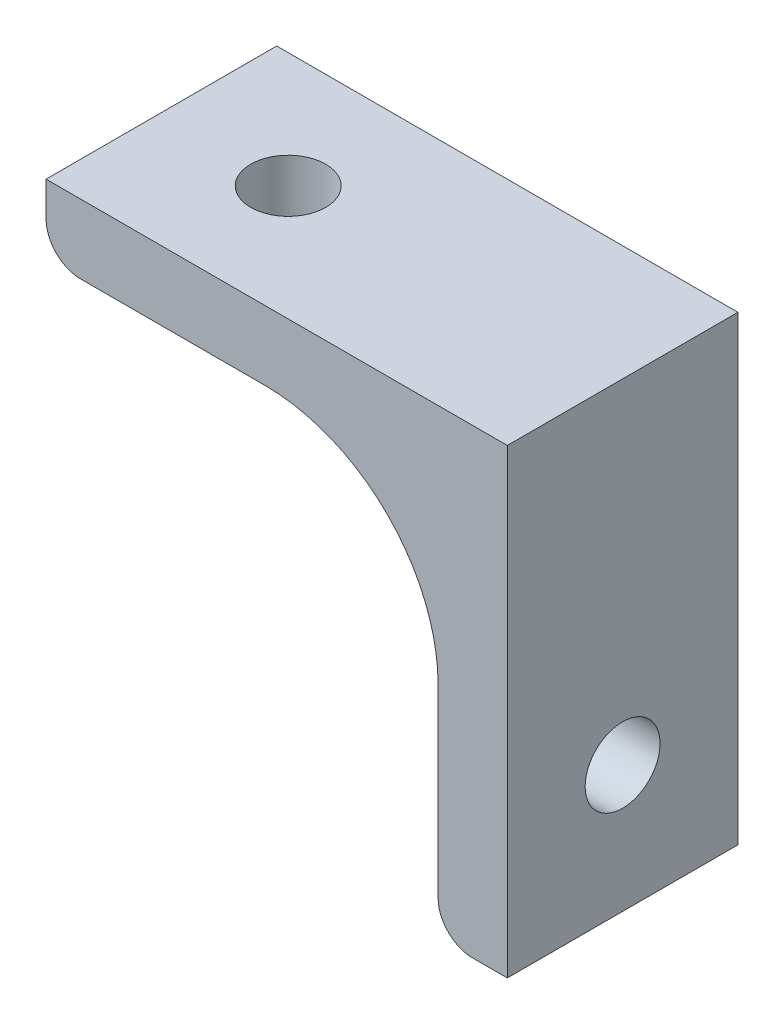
ISO-10303-21;
HEADER;
FILE_DESCRIPTION(('STEP AP214'),'2;1');
FILE_NAME('part.step','',(''),(''),'','','');
FILE_SCHEMA(('AUTOMOTIVE_DESIGN { 1 0 10303 214 1 1 1 1 }'));
ENDSEC;
DATA;
#1=APPLICATION_CONTEXT('core data for automotive mechanical design processes');
#2=APPLICATION_PROTOCOL_DEFINITION('international standard','automotive_design',2000,#1);
#3=PRODUCT_CONTEXT('',#1,'mechanical');
#4=PRODUCT('Part','Part','',(#3));
#5=PRODUCT_RELATED_PRODUCT_CATEGORY('part','',(#4));
#6=PRODUCT_DEFINITION_FORMATION('','',#4);
#7=PRODUCT_DEFINITION_CONTEXT('part definition',#1,'design');
#8=PRODUCT_DEFINITION('design','',#6,#7);
#9=PRODUCT_DEFINITION_SHAPE('','',#8);
#10=(LENGTH_UNIT() NAMED_UNIT(*) SI_UNIT(.MILLI.,.METRE.));
#11=(NAMED_UNIT(*) PLANE_ANGLE_UNIT() SI_UNIT($,.RADIAN.));
#12=(NAMED_UNIT(*) SI_UNIT($,.STERADIAN.) SOLID_ANGLE_UNIT());
#13=UNCERTAINTY_MEASURE_WITH_UNIT(LENGTH_MEASURE(1.E-05),#10,'distance_accuracy_value','');
#14=(GEOMETRIC_REPRESENTATION_CONTEXT(3) GLOBAL_UNCERTAINTY_ASSIGNED_CONTEXT((#13)) GLOBAL_UNIT_ASSIGNED_CONTEXT((#10,
#11,#12)) REPRESENTATION_CONTEXT('',''));
#15=CARTESIAN_POINT('',(0.,0.,0.));
#16=DIRECTION('',(0.,0.,1.));
#17=DIRECTION('',(1.,0.,0.));
#18=AXIS2_PLACEMENT_3D('',#15,#16,#17);
#19=CARTESIAN_POINT('',(-2.99999999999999,-37.,20.));
#20=DIRECTION('',(0.,0.,-1.));
#21=DIRECTION('',(-1.,0.,0.));
#22=AXIS2_PLACEMENT_3D('',#19,#20,#21);
#23=CYLINDRICAL_SURFACE('',#22,3.);
#24=CARTESIAN_POINT('',(-2.99999999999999,-37.,0.));
#25=DIRECTION('',(0.,0.,1.));
#26=DIRECTION('',(1.,0.,0.));
#27=AXIS2_PLACEMENT_3D('',#24,#25,#26);
#28=CIRCLE('',#27,3.);
#29=CARTESIAN_POINT('',(-2.99999999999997,-40.,0.));
#30=VERTEX_POINT('',#29);
#31=CARTESIAN_POINT('',(-5.99999999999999,-37.,0.));
#32=VERTEX_POINT('',#31);
#33=EDGE_CURVE('E108',#30,#32,#28,.F.);
#34=ORIENTED_EDGE('',*,*,#33,.F.);
#35=DIRECTION('',(0.,0.,-1.));
#36=VECTOR('',#35,1.);
#37=CARTESIAN_POINT('',(-2.99999999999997,-40.,20.));
#38=LINE('',#37,#36);
#39=CARTESIAN_POINT('',(-2.99999999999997,-40.,20.));
#40=VERTEX_POINT('',#39);
#41=EDGE_CURVE('E11',#40,#30,#38,.T.);
#42=ORIENTED_EDGE('',*,*,#41,.F.);
#43=CARTESIAN_POINT('',(-2.99999999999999,-37.,20.));
#44=DIRECTION('',(0.,0.,1.));
#45=DIRECTION('',(1.,0.,0.));
#46=AXIS2_PLACEMENT_3D('',#43,#44,#45);
#47=CIRCLE('',#46,3.);
#48=CARTESIAN_POINT('',(-5.99999999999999,-37.,20.));
#49=VERTEX_POINT('',#48);
#50=EDGE_CURVE('E139',#40,#49,#47,.F.);
#51=ORIENTED_EDGE('',*,*,#50,.T.);
#52=DIRECTION('',(0.,0.,-1.));
#53=VECTOR('',#52,1.);
#54=CARTESIAN_POINT('',(-5.99999999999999,-37.,20.));
#55=LINE('',#54,#53);
#56=EDGE_CURVE('E109',#49,#32,#55,.T.);
#57=ORIENTED_EDGE('',*,*,#56,.T.);
#58=EDGE_LOOP('',(#34,#42,#51,#57));
#59=FACE_BOUND('',#58,.T.);
#60=ADVANCED_FACE('F27',(#59),#23,.T.);
#61=CARTESIAN_POINT('',(-10.,-40.,20.));
#62=DIRECTION('',(0.,-1.,0.));
#63=DIRECTION('',(0.,0.,-1.));
#64=AXIS2_PLACEMENT_3D('',#61,#62,#63);
#65=PLANE('',#64);
#66=DIRECTION('',(-1.,0.,0.));
#67=VECTOR('',#66,1.);
#68=CARTESIAN_POINT('',(-10.,-40.,0.));
#69=LINE('',#68,#67);
#70=CARTESIAN_POINT('',(0.,-40.,0.));
#71=VERTEX_POINT('',#70);
#72=EDGE_CURVE('E101',#71,#30,#69,.T.);
#73=ORIENTED_EDGE('',*,*,#72,.F.);
#74=DIRECTION('',(0.,0.,-1.));
#75=VECTOR('',#74,1.);
#76=CARTESIAN_POINT('',(0.,-40.,20.));
#77=LINE('',#76,#75);
#78=CARTESIAN_POINT('',(0.,-40.,20.));
#79=VERTEX_POINT('',#78);
#80=EDGE_CURVE('E34',#79,#71,#77,.T.);
#81=ORIENTED_EDGE('',*,*,#80,.F.);
#82=DIRECTION('',(-1.,0.,0.));
#83=VECTOR('',#82,1.);
#84=CARTESIAN_POINT('',(-10.,-40.,20.));
#85=LINE('',#84,#83);
#86=EDGE_CURVE('E104',#79,#40,#85,.T.);
#87=ORIENTED_EDGE('',*,*,#86,.T.);
#88=ORIENTED_EDGE('',*,*,#41,.T.);
#89=EDGE_LOOP('',(#73,#81,#87,#88));
#90=FACE_BOUND('',#89,.T.);
#91=ADVANCED_FACE('F99',(#90),#65,.T.);
#92=CARTESIAN_POINT('',(0.,-63.2541197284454,20.));
#93=DIRECTION('',(1.,0.,0.));
#94=DIRECTION('',(0.,1.,0.));
#95=AXIS2_PLACEMENT_3D('',#92,#93,#94);
#96=PLANE('',#95);
#97=CARTESIAN_POINT('',(0.,-29.,10.));
#98=DIRECTION('',(1.,0.,0.));
#99=DIRECTION('',(0.,1.,0.));
#100=AXIS2_PLACEMENT_3D('',#97,#98,#99);
#101=CIRCLE('',#100,3.25);
#102=CARTESIAN_POINT('',(0.,-25.75,10.));
#103=VERTEX_POINT('',#102);
#104=EDGE_CURVE('E278',#103,#103,#101,.T.);
#105=ORIENTED_EDGE('',*,*,#104,.F.);
#106=EDGE_LOOP('',(#105));
#107=FACE_BOUND('',#106,.T.);
#108=DIRECTION('',(0.,-1.,0.));
#109=VECTOR('',#108,1.);
#110=CARTESIAN_POINT('',(0.,-63.2541197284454,0.));
#111=LINE('',#110,#109);
#112=CARTESIAN_POINT('',(0.,0.,0.));
#113=VERTEX_POINT('',#112);
#114=EDGE_CURVE('E118',#113,#71,#111,.T.);
#115=ORIENTED_EDGE('',*,*,#114,.F.);
#116=DIRECTION('',(0.,0.,-1.));
#117=VECTOR('',#116,1.);
#118=CARTESIAN_POINT('',(0.,0.,20.));
#119=LINE('',#118,#117);
#120=CARTESIAN_POINT('',(0.,0.,20.));
#121=VERTEX_POINT('',#120);
#122=EDGE_CURVE('E168',#121,#113,#119,.T.);
#123=ORIENTED_EDGE('',*,*,#122,.F.);
#124=DIRECTION('',(0.,-1.,0.));
#125=VECTOR('',#124,1.);
#126=CARTESIAN_POINT('',(0.,-63.2541197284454,20.));
#127=LINE('',#126,#125);
#128=EDGE_CURVE('E142',#121,#79,#127,.T.);
#129=ORIENTED_EDGE('',*,*,#128,.T.);
#130=ORIENTED_EDGE('',*,*,#80,.T.);
#131=EDGE_LOOP('',(#115,#123,#129,#130));
#132=FACE_BOUND('',#131,.T.);
#133=ADVANCED_FACE('F170',(#107,#132),#96,.T.);
#134=CARTESIAN_POINT('',(-10.,0.,20.));
#135=DIRECTION('',(0.,-1.,0.));
#136=DIRECTION('',(1.,0.,0.));
#137=AXIS2_PLACEMENT_3D('',#134,#135,#136);
#138=PLANE('',#137);
#139=CARTESIAN_POINT('',(-29.,0.,10.));
#140=DIRECTION('',(0.,-1.,0.));
#141=DIRECTION('',(1.,0.,0.));
#142=AXIS2_PLACEMENT_3D('',#139,#140,#141);
#143=CIRCLE('',#142,3.25);
#144=CARTESIAN_POINT('',(-25.75,0.,10.));
#145=VERTEX_POINT('',#144);
#146=EDGE_CURVE('E113',#145,#145,#143,.T.);
#147=ORIENTED_EDGE('',*,*,#146,.T.);
#148=EDGE_LOOP('',(#147));
#149=FACE_BOUND('',#148,.T.);
#150=DIRECTION('',(-1.,0.,0.));
#151=VECTOR('',#150,1.);
#152=CARTESIAN_POINT('',(-10.,0.,0.));
#153=LINE('',#152,#151);
#154=CARTESIAN_POINT('',(-40.,0.,0.));
#155=VERTEX_POINT('',#154);
#156=EDGE_CURVE('E120',#113,#155,#153,.T.);
#157=ORIENTED_EDGE('',*,*,#156,.T.);
#158=DIRECTION('',(0.,0.,-1.));
#159=VECTOR('',#158,1.);
#160=CARTESIAN_POINT('',(-40.,0.,20.));
#161=LINE('',#160,#159);
#162=CARTESIAN_POINT('',(-40.,0.,20.));
#163=VERTEX_POINT('',#162);
#164=EDGE_CURVE('E165',#163,#155,#161,.T.);
#165=ORIENTED_EDGE('',*,*,#164,.F.);
#166=DIRECTION('',(-1.,0.,0.));
#167=VECTOR('',#166,1.);
#168=CARTESIAN_POINT('',(-10.,0.,20.));
#169=LINE('',#168,#167);
#170=EDGE_CURVE('E145',#121,#163,#169,.T.);
#171=ORIENTED_EDGE('',*,*,#170,.F.);
#172=ORIENTED_EDGE('',*,*,#122,.T.);
#173=EDGE_LOOP('',(#157,#165,#171,#172));
#174=FACE_BOUND('',#173,.T.);
#175=ADVANCED_FACE('F179',(#149,#174),#138,.F.);
#176=CARTESIAN_POINT('',(-40.,-63.2541197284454,20.));
#177=DIRECTION('',(1.,0.,0.));
#178=DIRECTION('',(0.,0.,-1.));
#179=AXIS2_PLACEMENT_3D('',#176,#177,#178);
#180=PLANE('',#179);
#181=DIRECTION('',(0.,-1.,0.));
#182=VECTOR('',#181,1.);
#183=CARTESIAN_POINT('',(-40.,-63.2541197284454,0.));
#184=LINE('',#183,#182);
#185=CARTESIAN_POINT('',(-40.,-2.99999999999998,0.));
#186=VERTEX_POINT('',#185);
#187=EDGE_CURVE('E125',#155,#186,#184,.T.);
#188=ORIENTED_EDGE('',*,*,#187,.T.);
#189=DIRECTION('',(0.,0.,-1.));
#190=VECTOR('',#189,1.);
#191=CARTESIAN_POINT('',(-40.,-2.99999999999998,20.));
#192=LINE('',#191,#190);
#193=CARTESIAN_POINT('',(-40.,-2.99999999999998,20.));
#194=VERTEX_POINT('',#193);
#195=EDGE_CURVE('E163',#194,#186,#192,.T.);
#196=ORIENTED_EDGE('',*,*,#195,.F.);
#197=DIRECTION('',(0.,-1.,0.));
#198=VECTOR('',#197,1.);
#199=CARTESIAN_POINT('',(-40.,-63.2541197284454,20.));
#200=LINE('',#199,#198);
#201=EDGE_CURVE('E147',#163,#194,#200,.T.);
#202=ORIENTED_EDGE('',*,*,#201,.F.);
#203=ORIENTED_EDGE('',*,*,#164,.T.);
#204=EDGE_LOOP('',(#188,#196,#202,#203));
#205=FACE_BOUND('',#204,.T.);
#206=ADVANCED_FACE('F182',(#205),#180,.F.);
#207=CARTESIAN_POINT('',(-37.,-3.00000000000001,20.));
#208=DIRECTION('',(0.,0.,-1.));
#209=DIRECTION('',(-1.,0.,0.));
#210=AXIS2_PLACEMENT_3D('',#207,#208,#209);
#211=CYLINDRICAL_SURFACE('',#210,3.);
#212=CARTESIAN_POINT('',(-37.,-3.00000000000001,0.));
#213=DIRECTION('',(0.,0.,1.));
#214=DIRECTION('',(1.,0.,0.));
#215=AXIS2_PLACEMENT_3D('',#212,#213,#214);
#216=CIRCLE('',#215,3.);
#217=CARTESIAN_POINT('',(-37.,-6.00000000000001,0.));
#218=VERTEX_POINT('',#217);
#219=EDGE_CURVE('E128',#218,#186,#216,.F.);
#220=ORIENTED_EDGE('',*,*,#219,.F.);
#221=DIRECTION('',(0.,0.,-1.));
#222=VECTOR('',#221,1.);
#223=CARTESIAN_POINT('',(-37.,-6.00000000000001,20.));
#224=LINE('',#223,#222);
#225=CARTESIAN_POINT('',(-37.,-6.00000000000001,20.));
#226=VERTEX_POINT('',#225);
#227=EDGE_CURVE('E161',#226,#218,#224,.T.);
#228=ORIENTED_EDGE('',*,*,#227,.F.);
#229=CARTESIAN_POINT('',(-37.,-3.00000000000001,20.));
#230=DIRECTION('',(0.,0.,1.));
#231=DIRECTION('',(1.,0.,0.));
#232=AXIS2_PLACEMENT_3D('',#229,#230,#231);
#233=CIRCLE('',#232,3.);
#234=EDGE_CURVE('E149',#226,#194,#233,.F.);
#235=ORIENTED_EDGE('',*,*,#234,.T.);
#236=ORIENTED_EDGE('',*,*,#195,.T.);
#237=EDGE_LOOP('',(#220,#228,#235,#236));
#238=FACE_BOUND('',#237,.T.);
#239=ADVANCED_FACE('F185',(#238),#211,.T.);
#240=CARTESIAN_POINT('',(-10.,-6.00000000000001,20.));
#241=DIRECTION('',(0.,1.,0.));
#242=DIRECTION('',(0.,0.,1.));
#243=AXIS2_PLACEMENT_3D('',#240,#241,#242);
#244=PLANE('',#243);
#245=CARTESIAN_POINT('',(-29.,-6.00000000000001,10.));
#246=DIRECTION('',(0.,-1.,0.));
#247=DIRECTION('',(0.,0.,-1.));
#248=AXIS2_PLACEMENT_3D('',#245,#246,#247);
#249=CIRCLE('',#248,3.25);
#250=CARTESIAN_POINT('',(-29.,-6.00000000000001,6.75));
#251=VERTEX_POINT('',#250);
#252=EDGE_CURVE('E275',#251,#251,#249,.T.);
#253=ORIENTED_EDGE('',*,*,#252,.F.);
#254=EDGE_LOOP('',(#253));
#255=FACE_BOUND('',#254,.T.);
#256=DIRECTION('',(1.,0.,0.));
#257=VECTOR('',#256,1.);
#258=CARTESIAN_POINT('',(-10.,-6.00000000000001,0.));
#259=LINE('',#258,#257);
#260=CARTESIAN_POINT('',(-21.0000000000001,-6.00000000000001,0.));
#261=VERTEX_POINT('',#260);
#262=EDGE_CURVE('E131',#218,#261,#259,.T.);
#263=ORIENTED_EDGE('',*,*,#262,.T.);
#264=DIRECTION('',(0.,0.,-1.));
#265=VECTOR('',#264,1.);
#266=CARTESIAN_POINT('',(-21.0000000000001,-6.00000000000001,20.));
#267=LINE('',#266,#265);
#268=CARTESIAN_POINT('',(-21.0000000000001,-6.00000000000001,20.));
#269=VERTEX_POINT('',#268);
#270=EDGE_CURVE('E159',#269,#261,#267,.T.);
#271=ORIENTED_EDGE('',*,*,#270,.F.);
#272=DIRECTION('',(1.,0.,0.));
#273=VECTOR('',#272,1.);
#274=CARTESIAN_POINT('',(-10.,-6.00000000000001,20.));
#275=LINE('',#274,#273);
#276=EDGE_CURVE('E152',#226,#269,#275,.T.);
#277=ORIENTED_EDGE('',*,*,#276,.F.);
#278=ORIENTED_EDGE('',*,*,#227,.T.);
#279=EDGE_LOOP('',(#263,#271,#277,#278));
#280=FACE_BOUND('',#279,.T.);
#281=ADVANCED_FACE('F189',(#255,#280),#244,.F.);
#282=CARTESIAN_POINT('',(-21.,-21.,20.));
#283=DIRECTION('',(0.,0.,-1.));
#284=DIRECTION('',(-1.,0.,0.));
#285=AXIS2_PLACEMENT_3D('',#282,#283,#284);
#286=CYLINDRICAL_SURFACE('',#285,15.);
#287=CARTESIAN_POINT('',(-21.,-21.,0.));
#288=DIRECTION('',(0.,0.,1.));
#289=DIRECTION('',(1.,0.,0.));
#290=AXIS2_PLACEMENT_3D('',#287,#288,#289);
#291=CIRCLE('',#290,15.);
#292=CARTESIAN_POINT('',(-5.99999999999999,-21.0000000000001,0.));
#293=VERTEX_POINT('',#292);
#294=EDGE_CURVE('E134',#293,#261,#291,.T.);
#295=ORIENTED_EDGE('',*,*,#294,.F.);
#296=DIRECTION('',(0.,0.,-1.));
#297=VECTOR('',#296,1.);
#298=CARTESIAN_POINT('',(-5.99999999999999,-21.0000000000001,20.));
#299=LINE('',#298,#297);
#300=CARTESIAN_POINT('',(-5.99999999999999,-21.0000000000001,20.));
#301=VERTEX_POINT('',#300);
#302=EDGE_CURVE('E49',#301,#293,#299,.T.);
#303=ORIENTED_EDGE('',*,*,#302,.F.);
#304=CARTESIAN_POINT('',(-21.,-21.,20.));
#305=DIRECTION('',(0.,0.,1.));
#306=DIRECTION('',(1.,0.,0.));
#307=AXIS2_PLACEMENT_3D('',#304,#305,#306);
#308=CIRCLE('',#307,15.);
#309=EDGE_CURVE('E154',#301,#269,#308,.T.);
#310=ORIENTED_EDGE('',*,*,#309,.T.);
#311=ORIENTED_EDGE('',*,*,#270,.T.);
#312=EDGE_LOOP('',(#295,#303,#310,#311));
#313=FACE_BOUND('',#312,.T.);
#314=ADVANCED_FACE('F191',(#313),#286,.F.);
#315=CARTESIAN_POINT('',(-5.99999999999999,-63.2541197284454,20.));
#316=DIRECTION('',(1.,0.,0.));
#317=DIRECTION('',(0.,0.,-1.));
#318=AXIS2_PLACEMENT_3D('',#315,#316,#317);
#319=PLANE('',#318);
#320=CARTESIAN_POINT('',(-5.99999999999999,-29.,10.));
#321=DIRECTION('',(-1.,0.,0.));
#322=DIRECTION('',(0.,0.,1.));
#323=AXIS2_PLACEMENT_3D('',#320,#321,#322);
#324=CIRCLE('',#323,3.25);
#325=CARTESIAN_POINT('',(-5.99999999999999,-29.,13.25));
#326=VERTEX_POINT('',#325);
#327=EDGE_CURVE('E283',#326,#326,#324,.T.);
#328=ORIENTED_EDGE('',*,*,#327,.F.);
#329=EDGE_LOOP('',(#328));
#330=FACE_BOUND('',#329,.T.);
#331=DIRECTION('',(0.,-1.,0.));
#332=VECTOR('',#331,1.);
#333=CARTESIAN_POINT('',(-5.99999999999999,-63.2541197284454,0.));
#334=LINE('',#333,#332);
#335=EDGE_CURVE('E137',#293,#32,#334,.T.);
#336=ORIENTED_EDGE('',*,*,#335,.T.);
#337=ORIENTED_EDGE('',*,*,#56,.F.);
#338=DIRECTION('',(0.,-1.,0.));
#339=VECTOR('',#338,1.);
#340=CARTESIAN_POINT('',(-5.99999999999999,-63.2541197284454,20.));
#341=LINE('',#340,#339);
#342=EDGE_CURVE('E41',#301,#49,#341,.T.);
#343=ORIENTED_EDGE('',*,*,#342,.F.);
#344=ORIENTED_EDGE('',*,*,#302,.T.);
#345=EDGE_LOOP('',(#336,#337,#343,#344));
#346=FACE_BOUND('',#345,.T.);
#347=ADVANCED_FACE('F193',(#330,#346),#319,.F.);
#348=CARTESIAN_POINT('',(-10.,-63.2541197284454,20.));
#349=DIRECTION('',(0.,0.,1.));
#350=DIRECTION('',(1.,0.,0.));
#351=AXIS2_PLACEMENT_3D('',#348,#349,#350);
#352=PLANE('',#351);
#353=ORIENTED_EDGE('',*,*,#50,.F.);
#354=ORIENTED_EDGE('',*,*,#86,.F.);
#355=ORIENTED_EDGE('',*,*,#128,.F.);
#356=ORIENTED_EDGE('',*,*,#170,.T.);
#357=ORIENTED_EDGE('',*,*,#201,.T.);
#358=ORIENTED_EDGE('',*,*,#234,.F.);
#359=ORIENTED_EDGE('',*,*,#276,.T.);
#360=ORIENTED_EDGE('',*,*,#309,.F.);
#361=ORIENTED_EDGE('',*,*,#342,.T.);
#362=EDGE_LOOP('',(#353,#354,#355,#356,#357,#358,#359,#360,#361));
#363=FACE_BOUND('',#362,.T.);
#364=ADVANCED_FACE('F172',(#363),#352,.T.);
#365=CARTESIAN_POINT('',(-10.,-63.2541197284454,0.));
#366=DIRECTION('',(0.,0.,1.));
#367=DIRECTION('',(1.,0.,0.));
#368=AXIS2_PLACEMENT_3D('',#365,#366,#367);
#369=PLANE('',#368);
#370=ORIENTED_EDGE('',*,*,#33,.T.);
#371=ORIENTED_EDGE('',*,*,#335,.F.);
#372=ORIENTED_EDGE('',*,*,#294,.T.);
#373=ORIENTED_EDGE('',*,*,#262,.F.);
#374=ORIENTED_EDGE('',*,*,#219,.T.);
#375=ORIENTED_EDGE('',*,*,#187,.F.);
#376=ORIENTED_EDGE('',*,*,#156,.F.);
#377=ORIENTED_EDGE('',*,*,#114,.T.);
#378=ORIENTED_EDGE('',*,*,#72,.T.);
#379=EDGE_LOOP('',(#370,#371,#372,#373,#374,#375,#376,#377,#378));
#380=FACE_BOUND('',#379,.T.);
#381=ADVANCED_FACE('F115',(#380),#369,.F.);
#382=CARTESIAN_POINT('',(-29.,3.99999999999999,10.));
#383=DIRECTION('',(0.,-1.,0.));
#384=DIRECTION('',(0.,0.,-1.));
#385=AXIS2_PLACEMENT_3D('',#382,#383,#384);
#386=CYLINDRICAL_SURFACE('',#385,3.25);
#387=ORIENTED_EDGE('',*,*,#252,.T.);
#388=EDGE_LOOP('',(#387));
#389=FACE_BOUND('',#388,.T.);
#390=ORIENTED_EDGE('',*,*,#146,.F.);
#391=EDGE_LOOP('',(#390));
#392=FACE_BOUND('',#391,.T.);
#393=ADVANCED_FACE('F243',(#389,#392),#386,.F.);
#394=CARTESIAN_POINT('',(4.00000000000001,-29.,10.));
#395=DIRECTION('',(-1.,0.,0.));
#396=DIRECTION('',(0.,0.,1.));
#397=AXIS2_PLACEMENT_3D('',#394,#395,#396);
#398=CYLINDRICAL_SURFACE('',#397,3.25);
#399=ORIENTED_EDGE('',*,*,#104,.T.);
#400=EDGE_LOOP('',(#399));
#401=FACE_BOUND('',#400,.T.);
#402=ORIENTED_EDGE('',*,*,#327,.T.);
#403=EDGE_LOOP('',(#402));
#404=FACE_BOUND('',#403,.T.);
#405=ADVANCED_FACE('F252',(#401,#404),#398,.F.);
#406=CLOSED_SHELL('',(#60,#91,#133,#175,#206,#239,#281,#314,#347,#364,#381,#393,#405));
#407=MANIFOLD_SOLID_BREP('B2',#406);
#408=ADVANCED_BREP_SHAPE_REPRESENTATION('',(#18,#407),#14);
#409=SHAPE_DEFINITION_REPRESENTATION(#9,#408);
ENDSEC;
END-ISO-10303-21;
